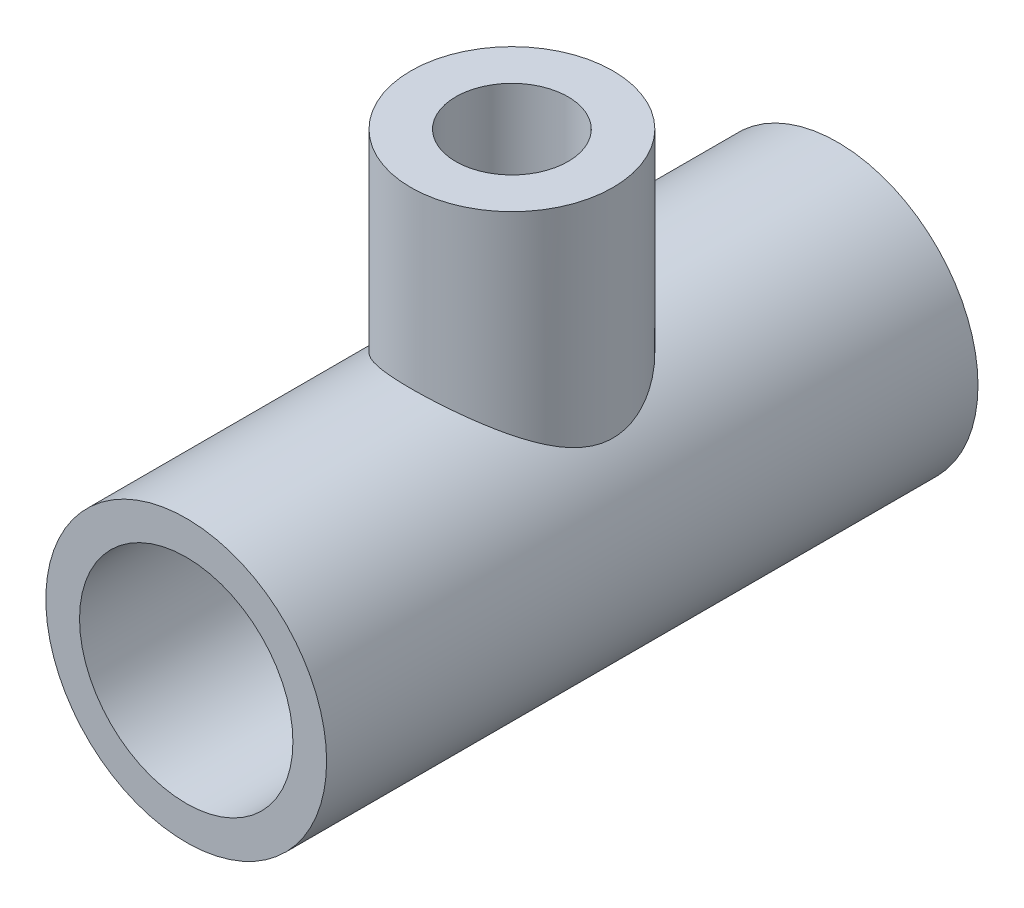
ISO-10303-21;
HEADER;
FILE_DESCRIPTION(('STEP AP214'),'2;1');
FILE_NAME('part.step','',(''),(''),'','','');
FILE_SCHEMA(('AUTOMOTIVE_DESIGN { 1 0 10303 214 1 1 1 1 }'));
ENDSEC;
DATA;
#1=APPLICATION_CONTEXT('core data for automotive mechanical design processes');
#2=APPLICATION_PROTOCOL_DEFINITION('international standard','automotive_design',2000,#1);
#3=PRODUCT_CONTEXT('',#1,'mechanical');
#4=PRODUCT('Part','Part','',(#3));
#5=PRODUCT_RELATED_PRODUCT_CATEGORY('part','',(#4));
#6=PRODUCT_DEFINITION_FORMATION('','',#4);
#7=PRODUCT_DEFINITION_CONTEXT('part definition',#1,'design');
#8=PRODUCT_DEFINITION('design','',#6,#7);
#9=PRODUCT_DEFINITION_SHAPE('','',#8);
#10=(LENGTH_UNIT() NAMED_UNIT(*) SI_UNIT(.MILLI.,.METRE.));
#11=(NAMED_UNIT(*) PLANE_ANGLE_UNIT() SI_UNIT($,.RADIAN.));
#12=(NAMED_UNIT(*) SI_UNIT($,.STERADIAN.) SOLID_ANGLE_UNIT());
#13=UNCERTAINTY_MEASURE_WITH_UNIT(LENGTH_MEASURE(1.E-05),#10,'distance_accuracy_value','');
#14=(GEOMETRIC_REPRESENTATION_CONTEXT(3) GLOBAL_UNCERTAINTY_ASSIGNED_CONTEXT((#13)) GLOBAL_UNIT_ASSIGNED_CONTEXT((#10,
#11,#12)) REPRESENTATION_CONTEXT('',''));
#15=CARTESIAN_POINT('',(0.,0.,0.));
#16=DIRECTION('',(0.,0.,1.));
#17=DIRECTION('',(1.,0.,0.));
#18=AXIS2_PLACEMENT_3D('',#15,#16,#17);
#19=CARTESIAN_POINT('',(0.,0.,29.));
#20=DIRECTION('',(0.,0.,-1.));
#21=DIRECTION('',(-1.,0.,0.));
#22=AXIS2_PLACEMENT_3D('',#19,#20,#21);
#23=CYLINDRICAL_SURFACE('',#22,6.25);
#24=CARTESIAN_POINT('',(0.,0.,29.));
#25=DIRECTION('',(0.,0.,1.));
#26=DIRECTION('',(1.,0.,0.));
#27=AXIS2_PLACEMENT_3D('',#24,#25,#26);
#28=CIRCLE('',#27,6.25);
#29=CARTESIAN_POINT('',(6.25,0.,29.));
#30=VERTEX_POINT('',#29);
#31=EDGE_CURVE('E48',#30,#30,#28,.T.);
#32=ORIENTED_EDGE('',*,*,#31,.F.);
#33=EDGE_LOOP('',(#32));
#34=FACE_BOUND('',#33,.T.);
#35=CARTESIAN_POINT('',(0.,0.,0.));
#36=DIRECTION('',(0.,0.,1.));
#37=DIRECTION('',(1.,0.,0.));
#38=AXIS2_PLACEMENT_3D('',#35,#36,#37);
#39=CIRCLE('',#38,6.25);
#40=CARTESIAN_POINT('',(6.25,0.,0.));
#41=VERTEX_POINT('',#40);
#42=EDGE_CURVE('E52',#41,#41,#39,.T.);
#43=ORIENTED_EDGE('',*,*,#42,.T.);
#44=EDGE_LOOP('',(#43));
#45=FACE_BOUND('',#44,.T.);
#46=CARTESIAN_POINT('',(0.,6.25,10.));
#47=CARTESIAN_POINT('',(-0.11113992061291,6.25000051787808,9.99999945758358));
#48=CARTESIAN_POINT('',(-0.222272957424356,6.24702951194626,10.0041229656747));
#49=CARTESIAN_POINT('',(-0.443657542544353,6.23521934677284,10.0205477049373));
#50=CARTESIAN_POINT('',(-0.553908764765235,6.22637810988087,10.0328518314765));
#51=CARTESIAN_POINT('',(-0.772599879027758,6.20303759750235,10.0654418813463));
#52=CARTESIAN_POINT('',(-0.881040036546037,6.18853915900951,10.0857266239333));
#53=CARTESIAN_POINT('',(-1.09535961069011,6.15422570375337,10.1339633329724));
#54=CARTESIAN_POINT('',(-1.20123790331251,6.13440839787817,10.1619186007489));
#55=CARTESIAN_POINT('',(-1.51281845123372,6.06783979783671,10.2563921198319));
#56=CARTESIAN_POINT('',(-1.71381730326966,6.01381969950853,10.3337257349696));
#57=CARTESIAN_POINT('',(-2.09878970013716,5.89055041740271,10.5137269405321));
#58=CARTESIAN_POINT('',(-2.28276086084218,5.82129910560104,10.6163980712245));
#59=CARTESIAN_POINT('',(-2.6473829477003,5.66538754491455,10.854057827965));
#60=CARTESIAN_POINT('',(-2.82624026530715,5.57772080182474,10.9911251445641));
#61=CARTESIAN_POINT('',(-3.16005720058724,5.3956215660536,11.2884401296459));
#62=CARTESIAN_POINT('',(-3.31498020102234,5.30117902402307,11.4487226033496));
#63=CARTESIAN_POINT('',(-3.54166708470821,5.1506702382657,11.7207930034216));
#64=CARTESIAN_POINT('',(-3.62165422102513,5.09459295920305,11.8258446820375));
#65=CARTESIAN_POINT('',(-3.77246487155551,4.98394874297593,12.0431707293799));
#66=CARTESIAN_POINT('',(-3.84328584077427,4.92938222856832,12.1554470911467));
#67=CARTESIAN_POINT('',(-3.97521811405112,4.82361710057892,12.3868633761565));
#68=CARTESIAN_POINT('',(-4.03634275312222,4.77241391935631,12.5059935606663));
#69=CARTESIAN_POINT('',(-4.14839229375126,4.6753430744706,12.7509979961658));
#70=CARTESIAN_POINT('',(-4.19931883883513,4.6294745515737,12.8768711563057));
#71=CARTESIAN_POINT('',(-4.30608955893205,4.53068429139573,13.1802968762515));
#72=CARTESIAN_POINT('',(-4.3574475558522,4.48088742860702,13.3605546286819));
#73=CARTESIAN_POINT('',(-4.41759766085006,4.42132545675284,13.6375762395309));
#74=CARTESIAN_POINT('',(-4.43482862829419,4.40399877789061,13.7309722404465));
#75=CARTESIAN_POINT('',(-4.46342001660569,4.37502002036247,13.9195200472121));
#76=CARTESIAN_POINT('',(-4.47478278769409,4.36336567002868,14.0146711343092));
#77=CARTESIAN_POINT('',(-4.49147684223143,4.34618014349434,14.2067476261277));
#78=CARTESIAN_POINT('',(-4.49676429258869,4.34069347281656,14.3036808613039));
#79=CARTESIAN_POINT('',(-4.5010467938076,4.33625274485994,14.4978357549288));
#80=CARTESIAN_POINT('',(-4.50004205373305,4.33729847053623,14.5950574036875));
#81=CARTESIAN_POINT('',(-4.49176022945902,4.34587443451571,14.7889890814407));
#82=CARTESIAN_POINT('',(-4.4844801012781,4.35340781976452,14.8856988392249));
#83=CARTESIAN_POINT('',(-4.46379574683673,4.37461368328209,15.0778152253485));
#84=CARTESIAN_POINT('',(-4.45038845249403,4.3882892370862,15.1732211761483));
#85=CARTESIAN_POINT('',(-4.41570421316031,4.42320373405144,15.3735614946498));
#86=CARTESIAN_POINT('',(-4.39366695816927,4.44516164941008,15.4782390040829));
#87=CARTESIAN_POINT('',(-4.34262382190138,4.49504100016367,15.6844499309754));
#88=CARTESIAN_POINT('',(-4.31361325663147,4.52296644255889,15.7859811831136));
#89=CARTESIAN_POINT('',(-4.21667658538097,4.61410566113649,16.085459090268));
#90=CARTESIAN_POINT('',(-4.13888164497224,4.68464344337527,16.2780883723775));
#91=CARTESIAN_POINT('',(-3.99040441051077,4.8109481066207,16.5844863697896));
#92=CARTESIAN_POINT('',(-3.92623794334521,4.86362565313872,16.7028666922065));
#93=CARTESIAN_POINT('',(-3.78822668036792,4.9718730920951,16.9325443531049));
#94=CARTESIAN_POINT('',(-3.71437902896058,5.02744383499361,17.0438395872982));
#95=CARTESIAN_POINT('',(-3.55738310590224,5.13973254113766,17.2591289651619));
#96=CARTESIAN_POINT('',(-3.47422968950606,5.19645112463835,17.3631190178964));
#97=CARTESIAN_POINT('',(-3.29887852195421,5.30949981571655,17.5635162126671));
#98=CARTESIAN_POINT('',(-3.2066763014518,5.36582971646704,17.6599195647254));
#99=CARTESIAN_POINT('',(-3.01243590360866,5.47726231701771,17.8456661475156));
#100=CARTESIAN_POINT('',(-2.91030144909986,5.53234494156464,17.9349209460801));
#101=CARTESIAN_POINT('',(-2.69733776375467,5.6392432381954,18.1045664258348));
#102=CARTESIAN_POINT('',(-2.58650973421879,5.69105935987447,18.1849583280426));
#103=CARTESIAN_POINT('',(-2.35671317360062,5.78999230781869,18.3359822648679));
#104=CARTESIAN_POINT('',(-2.23775984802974,5.83711752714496,18.406631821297));
#105=CARTESIAN_POINT('',(-1.9921828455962,5.92543257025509,18.5373964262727));
#106=CARTESIAN_POINT('',(-1.86556208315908,5.96662462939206,18.5975154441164));
#107=CARTESIAN_POINT('',(-1.54197784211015,6.06013450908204,18.7327498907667));
#108=CARTESIAN_POINT('',(-1.34075439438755,6.1081194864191,18.8009378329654));
#109=CARTESIAN_POINT('',(-0.927277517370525,6.18439983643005,18.9085989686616));
#110=CARTESIAN_POINT('',(-0.715032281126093,6.2127096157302,18.9480931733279));
#111=CARTESIAN_POINT('',(-0.284493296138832,6.24726425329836,18.9962317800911));
#112=CARTESIAN_POINT('',(-0.0661815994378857,6.25343455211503,19.0047719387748));
#113=CARTESIAN_POINT('',(0.368819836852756,6.24290131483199,18.9901382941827));
#114=CARTESIAN_POINT('',(0.585509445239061,6.22619594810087,18.9669619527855));
#115=CARTESIAN_POINT('',(0.999632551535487,6.17289426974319,18.8923518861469));
#116=CARTESIAN_POINT('',(1.1974834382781,6.13736369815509,18.8424307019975));
#117=CARTESIAN_POINT('',(1.58131492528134,6.04985418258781,18.717842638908));
#118=CARTESIAN_POINT('',(1.76729308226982,5.99787186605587,18.6431706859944));
#119=CARTESIAN_POINT('',(2.14005992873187,5.87574872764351,18.4644120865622));
#120=CARTESIAN_POINT('',(2.32548729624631,5.80441464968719,18.3583190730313));
#121=CARTESIAN_POINT('',(2.67661540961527,5.65110666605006,18.1235903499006));
#122=CARTESIAN_POINT('',(2.84230164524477,5.56912502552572,17.9949382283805));
#123=CARTESIAN_POINT('',(3.18099012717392,5.38400136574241,17.6924681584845));
#124=CARTESIAN_POINT('',(3.34983736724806,5.27972344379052,17.5146914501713));
#125=CARTESIAN_POINT('',(3.65691468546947,5.07186704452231,17.1337973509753));
#126=CARTESIAN_POINT('',(3.7951247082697,4.96828906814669,16.9306634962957));
#127=CARTESIAN_POINT('',(4.02135790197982,4.78635489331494,16.5307055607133));
#128=CARTESIAN_POINT('',(4.1137079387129,4.70650104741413,16.337022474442));
#129=CARTESIAN_POINT('',(4.27120846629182,4.56405323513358,15.933019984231));
#130=CARTESIAN_POINT('',(4.33641628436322,4.50142298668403,15.7227367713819));
#131=CARTESIAN_POINT('',(4.42603034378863,4.4131548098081,15.3318921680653));
#132=CARTESIAN_POINT('',(4.45597071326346,4.38263814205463,15.1537323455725));
#133=CARTESIAN_POINT('',(4.49411690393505,4.34352547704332,14.7928044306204));
#134=CARTESIAN_POINT('',(4.50234997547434,4.33490199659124,14.6100424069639));
#135=CARTESIAN_POINT('',(4.49648518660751,4.34098214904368,14.2451620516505));
#136=CARTESIAN_POINT('',(4.48237230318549,4.3557014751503,14.0630442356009));
#137=CARTESIAN_POINT('',(4.43285909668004,4.40607054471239,13.7046208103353));
#138=CARTESIAN_POINT('',(4.39742542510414,4.44175307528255,13.5283247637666));
#139=CARTESIAN_POINT('',(4.29258223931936,4.54346456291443,13.1292210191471));
#140=CARTESIAN_POINT('',(4.21587819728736,4.6155839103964,12.9098876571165));
#141=CARTESIAN_POINT('',(4.0787848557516,4.73600473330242,12.5956216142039));
#142=CARTESIAN_POINT('',(4.02934136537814,4.77824354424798,12.4932075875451));
#143=CARTESIAN_POINT('',(3.92344467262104,4.86557282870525,12.2933384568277));
#144=CARTESIAN_POINT('',(3.86699191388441,4.91066312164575,12.1958830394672));
#145=CARTESIAN_POINT('',(3.68419462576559,5.05105454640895,11.9057870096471));
#146=CARTESIAN_POINT('',(3.54693743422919,5.1491507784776,11.7211734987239));
#147=CARTESIAN_POINT('',(3.32115575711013,5.29533099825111,11.4613999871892));
#148=CARTESIAN_POINT('',(3.24254109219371,5.34391775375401,11.3776342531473));
#149=CARTESIAN_POINT('',(3.07872411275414,5.43994084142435,11.2159934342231));
#150=CARTESIAN_POINT('',(2.99352011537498,5.48737687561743,11.1381198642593));
#151=CARTESIAN_POINT('',(2.79974351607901,5.58910561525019,10.9743123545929));
#152=CARTESIAN_POINT('',(2.68982351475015,5.64296804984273,10.8896978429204));
#153=CARTESIAN_POINT('',(2.46128494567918,5.74632875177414,10.7301882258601));
#154=CARTESIAN_POINT('',(2.34267030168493,5.79582896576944,10.6552887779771));
#155=CARTESIAN_POINT('',(2.09730498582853,5.88905954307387,10.5161341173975));
#156=CARTESIAN_POINT('',(1.97056005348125,5.93279391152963,10.4518715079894));
#157=CARTESIAN_POINT('',(1.70967495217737,6.01316232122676,10.3349762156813));
#158=CARTESIAN_POINT('',(1.57553720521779,6.04979867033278,10.2823397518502));
#159=CARTESIAN_POINT('',(1.32442882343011,6.10918037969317,10.1976365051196));
#160=CARTESIAN_POINT('',(1.20843053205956,6.13322912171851,10.1635927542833));
#161=CARTESIAN_POINT('',(0.972996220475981,6.17495422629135,10.1047763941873));
#162=CARTESIAN_POINT('',(0.853561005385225,6.19263206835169,10.0800016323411));
#163=CARTESIAN_POINT('',(0.612390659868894,6.22110974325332,10.0401906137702));
#164=CARTESIAN_POINT('',(0.490657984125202,6.23191653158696,10.0251445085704));
#165=CARTESIAN_POINT('',(0.245947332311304,6.24636109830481,10.0050498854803));
#166=CARTESIAN_POINT('',(0.122969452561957,6.24999942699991,10.0000006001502));
#167=CARTESIAN_POINT('',(0.,6.25,10.));
#168=B_SPLINE_CURVE_WITH_KNOTS('',3,(#46,#47,#48,#49,#50,#51,#52,#53,#54,#55,#56,#57,#58,#59,
#60,#61,#62,#63,#64,#65,#66,#67,#68,#69,#70,#71,#72,#73,#74,#75,#76,#77,#78,#79,#80,#81,#82,#83,
#84,#85,#86,#87,#88,#89,#90,#91,#92,#93,#94,#95,#96,#97,#98,#99,#100,#101,#102,#103,#104,#105,
#106,#107,#108,#109,#110,#111,#112,#113,#114,#115,#116,#117,#118,#119,#120,#121,#122,#123,#124,
#125,#126,#127,#128,#129,#130,#131,#132,#133,#134,#135,#136,#137,#138,#139,#140,#141,#142,#143,
#144,#145,#146,#147,#148,#149,#150,#151,#152,#153,#154,#155,#156,#157,#158,#159,#160,#161,#162,
#163,#164,#165,#166,#167),.UNSPECIFIED.,.T.,.F.,(4,2,2,2,2,2,2,2,2,2,2,2,2,2,2,2,2,2,2,2,2,2,2,
2,2,2,2,2,2,2,2,2,2,2,2,2,2,2,2,2,2,2,2,2,2,2,2,2,2,2,2,2,2,2,2,2,2,2,2,2,4),(0.,
0.33329219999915,0.666702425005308,1.00006334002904,1.3335679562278,1.99650505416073,
2.65953483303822,3.38232132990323,4.10620289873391,4.53614678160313,4.96620978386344,
5.39567611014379,5.82507316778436,6.40432316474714,6.69364695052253,6.98285477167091,
7.27413636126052,7.56540827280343,7.8568215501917,8.14838090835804,8.47549572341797,
8.80283087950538,9.45811862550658,9.89145431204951,10.3249181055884,10.7586227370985,
11.1925426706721,11.6311934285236,12.0697836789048,12.5075745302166,12.945200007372,
13.5956712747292,14.2456657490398,14.8978471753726,15.5500807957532,16.1688134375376,
16.7876729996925,17.4608453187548,18.1345094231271,18.9307591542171,19.7275285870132,
20.4120760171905,21.0951701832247,21.6424706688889,22.1890837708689,22.7360645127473,
23.2839030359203,24.0095421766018,24.373238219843,24.7369112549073,25.4841841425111,
25.8581426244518,26.2321969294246,26.6780060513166,27.1236152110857,27.5689131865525,
28.0140661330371,28.3833217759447,28.7524916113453,29.1212871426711,29.4900543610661),.UNSPECIFIED.);
#169=CARTESIAN_POINT('',(0.,6.25,10.));
#170=VERTEX_POINT('',#169);
#171=EDGE_CURVE('E10',#170,#170,#168,.T.);
#172=ORIENTED_EDGE('',*,*,#171,.F.);
#173=EDGE_LOOP('',(#172));
#174=FACE_BOUND('',#173,.T.);
#175=ADVANCED_FACE('F37',(#34,#45,#174),#23,.T.);
#176=CARTESIAN_POINT('',(0.,0.,29.));
#177=DIRECTION('',(0.,0.,1.));
#178=DIRECTION('',(1.,0.,0.));
#179=AXIS2_PLACEMENT_3D('',#176,#177,#178);
#180=PLANE('',#179);
#181=CARTESIAN_POINT('',(0.,0.,29.));
#182=DIRECTION('',(0.,0.,1.));
#183=DIRECTION('',(1.,0.,0.));
#184=AXIS2_PLACEMENT_3D('',#181,#182,#183);
#185=CIRCLE('',#184,4.75);
#186=CARTESIAN_POINT('',(-4.75,0.,29.));
#187=VERTEX_POINT('',#186);
#188=EDGE_CURVE('E65',#187,#187,#185,.T.);
#189=ORIENTED_EDGE('',*,*,#188,.F.);
#190=EDGE_LOOP('',(#189));
#191=FACE_BOUND('',#190,.T.);
#192=ORIENTED_EDGE('',*,*,#31,.T.);
#193=EDGE_LOOP('',(#192));
#194=FACE_BOUND('',#193,.T.);
#195=ADVANCED_FACE('F80',(#191,#194),#180,.T.);
#196=CARTESIAN_POINT('',(0.,0.,0.));
#197=DIRECTION('',(0.,0.,1.));
#198=DIRECTION('',(1.,0.,0.));
#199=AXIS2_PLACEMENT_3D('',#196,#197,#198);
#200=PLANE('',#199);
#201=CARTESIAN_POINT('',(0.,0.,0.));
#202=DIRECTION('',(0.,0.,-1.));
#203=DIRECTION('',(-1.,0.,0.));
#204=AXIS2_PLACEMENT_3D('',#201,#202,#203);
#205=CIRCLE('',#204,4.75);
#206=CARTESIAN_POINT('',(-4.75,0.,0.));
#207=VERTEX_POINT('',#206);
#208=EDGE_CURVE('E70',#207,#207,#205,.T.);
#209=ORIENTED_EDGE('',*,*,#208,.F.);
#210=EDGE_LOOP('',(#209));
#211=FACE_BOUND('',#210,.T.);
#212=ORIENTED_EDGE('',*,*,#42,.F.);
#213=EDGE_LOOP('',(#212));
#214=FACE_BOUND('',#213,.T.);
#215=ADVANCED_FACE('F76',(#211,#214),#200,.F.);
#216=CARTESIAN_POINT('',(0.,14.,14.5));
#217=DIRECTION('',(0.,-1.,0.));
#218=DIRECTION('',(0.,0.,-1.));
#219=AXIS2_PLACEMENT_3D('',#216,#217,#218);
#220=CYLINDRICAL_SURFACE('',#219,4.5);
#221=CARTESIAN_POINT('',(0.,14.,14.5));
#222=DIRECTION('',(0.,1.,0.));
#223=DIRECTION('',(0.,0.,1.));
#224=AXIS2_PLACEMENT_3D('',#221,#222,#223);
#225=CIRCLE('',#224,4.5);
#226=CARTESIAN_POINT('',(0.,14.,19.));
#227=VERTEX_POINT('',#226);
#228=EDGE_CURVE('E57',#227,#227,#225,.T.);
#229=ORIENTED_EDGE('',*,*,#228,.F.);
#230=EDGE_LOOP('',(#229));
#231=FACE_BOUND('',#230,.T.);
#232=ORIENTED_EDGE('',*,*,#171,.T.);
#233=EDGE_LOOP('',(#232));
#234=FACE_BOUND('',#233,.T.);
#235=ADVANCED_FACE('F79',(#231,#234),#220,.T.);
#236=CARTESIAN_POINT('',(0.,14.,14.5));
#237=DIRECTION('',(0.,1.,0.));
#238=DIRECTION('',(0.,0.,1.));
#239=AXIS2_PLACEMENT_3D('',#236,#237,#238);
#240=PLANE('',#239);
#241=CARTESIAN_POINT('',(0.,14.,14.5));
#242=DIRECTION('',(0.,1.,0.));
#243=DIRECTION('',(0.,0.,1.));
#244=AXIS2_PLACEMENT_3D('',#241,#242,#243);
#245=CIRCLE('',#244,2.5);
#246=CARTESIAN_POINT('',(0.,14.,17.));
#247=VERTEX_POINT('',#246);
#248=EDGE_CURVE('E62',#247,#247,#245,.T.);
#249=ORIENTED_EDGE('',*,*,#248,.F.);
#250=EDGE_LOOP('',(#249));
#251=FACE_BOUND('',#250,.T.);
#252=ORIENTED_EDGE('',*,*,#228,.T.);
#253=EDGE_LOOP('',(#252));
#254=FACE_BOUND('',#253,.T.);
#255=ADVANCED_FACE('F97',(#251,#254),#240,.T.);
#256=CARTESIAN_POINT('',(0.,8.,14.5));
#257=DIRECTION('',(0.,1.,0.));
#258=DIRECTION('',(0.,0.,1.));
#259=AXIS2_PLACEMENT_3D('',#256,#257,#258);
#260=CYLINDRICAL_SURFACE('',#259,2.5);
#261=CARTESIAN_POINT('',(0.,8.,14.5));
#262=DIRECTION('',(0.,1.,0.));
#263=DIRECTION('',(0.,0.,1.));
#264=AXIS2_PLACEMENT_3D('',#261,#262,#263);
#265=CIRCLE('',#264,2.5);
#266=CARTESIAN_POINT('',(0.,8.,17.));
#267=VERTEX_POINT('',#266);
#268=EDGE_CURVE('E61',#267,#267,#265,.T.);
#269=ORIENTED_EDGE('',*,*,#268,.F.);
#270=EDGE_LOOP('',(#269));
#271=FACE_BOUND('',#270,.T.);
#272=ORIENTED_EDGE('',*,*,#248,.T.);
#273=EDGE_LOOP('',(#272));
#274=FACE_BOUND('',#273,.T.);
#275=ADVANCED_FACE('F101',(#271,#274),#260,.F.);
#276=CARTESIAN_POINT('',(0.,8.,14.5));
#277=DIRECTION('',(0.,1.,0.));
#278=DIRECTION('',(0.,0.,1.));
#279=AXIS2_PLACEMENT_3D('',#276,#277,#278);
#280=PLANE('',#279);
#281=ORIENTED_EDGE('',*,*,#268,.T.);
#282=EDGE_LOOP('',(#281));
#283=FACE_BOUND('',#282,.T.);
#284=ADVANCED_FACE('F105',(#283),#280,.T.);
#285=CARTESIAN_POINT('',(0.,0.,119.785927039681));
#286=DIRECTION('',(0.,0.,-1.));
#287=DIRECTION('',(-1.,0.,0.));
#288=AXIS2_PLACEMENT_3D('',#285,#286,#287);
#289=CYLINDRICAL_SURFACE('',#288,4.75);
#290=CARTESIAN_POINT('',(-4.75,0.,29.));
#291=CARTESIAN_POINT('',(-4.75,0.,28.6979166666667));
#292=CARTESIAN_POINT('',(-4.75,0.,28.3958333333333));
#293=CARTESIAN_POINT('',(-4.75,0.,27.7916666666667));
#294=CARTESIAN_POINT('',(-4.75,0.,27.4895833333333));
#295=CARTESIAN_POINT('',(-4.75,0.,26.8854166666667));
#296=CARTESIAN_POINT('',(-4.75,0.,26.5833333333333));
#297=CARTESIAN_POINT('',(-4.75,0.,25.9791666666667));
#298=CARTESIAN_POINT('',(-4.75,0.,25.6770833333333));
#299=CARTESIAN_POINT('',(-4.75,0.,25.0729166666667));
#300=CARTESIAN_POINT('',(-4.75,0.,24.7708333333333));
#301=CARTESIAN_POINT('',(-4.75,0.,24.1666666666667));
#302=CARTESIAN_POINT('',(-4.75,0.,23.8645833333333));
#303=CARTESIAN_POINT('',(-4.75,0.,23.2604166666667));
#304=CARTESIAN_POINT('',(-4.75,0.,22.9583333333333));
#305=CARTESIAN_POINT('',(-4.75,0.,22.3541666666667));
#306=CARTESIAN_POINT('',(-4.75,0.,22.0520833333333));
#307=CARTESIAN_POINT('',(-4.75,0.,21.4479166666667));
#308=CARTESIAN_POINT('',(-4.75,0.,21.1458333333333));
#309=CARTESIAN_POINT('',(-4.75,0.,20.5416666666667));
#310=CARTESIAN_POINT('',(-4.75,0.,20.2395833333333));
#311=CARTESIAN_POINT('',(-4.75,0.,19.6354166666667));
#312=CARTESIAN_POINT('',(-4.75,0.,19.3333333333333));
#313=CARTESIAN_POINT('',(-4.75,0.,18.7291666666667));
#314=CARTESIAN_POINT('',(-4.75,0.,18.4270833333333));
#315=CARTESIAN_POINT('',(-4.75,0.,17.8229166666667));
#316=CARTESIAN_POINT('',(-4.75,0.,17.5208333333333));
#317=CARTESIAN_POINT('',(-4.75,0.,16.9166666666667));
#318=CARTESIAN_POINT('',(-4.75,0.,16.6145833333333));
#319=CARTESIAN_POINT('',(-4.75,0.,16.0104166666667));
#320=CARTESIAN_POINT('',(-4.75,0.,15.7083333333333));
#321=CARTESIAN_POINT('',(-4.75,0.,15.1041666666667));
#322=CARTESIAN_POINT('',(-4.75,0.,14.8020833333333));
#323=CARTESIAN_POINT('',(-4.75,0.,14.1979166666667));
#324=CARTESIAN_POINT('',(-4.75,0.,13.8958333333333));
#325=CARTESIAN_POINT('',(-4.75,0.,13.2916666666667));
#326=CARTESIAN_POINT('',(-4.75,0.,12.9895833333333));
#327=CARTESIAN_POINT('',(-4.75,0.,12.3854166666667));
#328=CARTESIAN_POINT('',(-4.75,0.,12.0833333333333));
#329=CARTESIAN_POINT('',(-4.75,0.,11.4791666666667));
#330=CARTESIAN_POINT('',(-4.75,0.,11.1770833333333));
#331=CARTESIAN_POINT('',(-4.75,0.,10.5729166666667));
#332=CARTESIAN_POINT('',(-4.75,0.,10.2708333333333));
#333=CARTESIAN_POINT('',(-4.75,0.,9.66666666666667));
#334=CARTESIAN_POINT('',(-4.75,0.,9.36458333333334));
#335=CARTESIAN_POINT('',(-4.75,0.,8.76041666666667));
#336=CARTESIAN_POINT('',(-4.75,0.,8.45833333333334));
#337=CARTESIAN_POINT('',(-4.75,0.,7.85416666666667));
#338=CARTESIAN_POINT('',(-4.75,0.,7.55208333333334));
#339=CARTESIAN_POINT('',(-4.75,0.,6.94791666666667));
#340=CARTESIAN_POINT('',(-4.75,0.,6.64583333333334));
#341=CARTESIAN_POINT('',(-4.75,0.,6.04166666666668));
#342=CARTESIAN_POINT('',(-4.75,0.,5.73958333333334));
#343=CARTESIAN_POINT('',(-4.75,0.,5.13541666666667));
#344=CARTESIAN_POINT('',(-4.75,0.,4.83333333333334));
#345=CARTESIAN_POINT('',(-4.75,0.,4.22916666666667));
#346=CARTESIAN_POINT('',(-4.75,0.,3.92708333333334));
#347=CARTESIAN_POINT('',(-4.75,0.,3.32291666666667));
#348=CARTESIAN_POINT('',(-4.75,0.,3.02083333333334));
#349=CARTESIAN_POINT('',(-4.75,0.,2.41666666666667));
#350=CARTESIAN_POINT('',(-4.75,0.,2.11458333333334));
#351=CARTESIAN_POINT('',(-4.75,0.,1.51041666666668));
#352=CARTESIAN_POINT('',(-4.75,0.,1.20833333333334));
#353=CARTESIAN_POINT('',(-4.75,0.,0.604166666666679));
#354=CARTESIAN_POINT('',(-4.75,0.,0.302083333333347));
#355=CARTESIAN_POINT('',(-4.75,0.,0.));
#356=B_SPLINE_CURVE_WITH_KNOTS('',3,(#290,#291,#292,#293,#294,#295,#296,#297,#298,#299,#300,
#301,#302,#303,#304,#305,#306,#307,#308,#309,#310,#311,#312,#313,#314,#315,#316,#317,#318,#319,
#320,#321,#322,#323,#324,#325,#326,#327,#328,#329,#330,#331,#332,#333,#334,#335,#336,#337,#338,
#339,#340,#341,#342,#343,#344,#345,#346,#347,#348,#349,#350,#351,#352,#353,#354,#355),
.UNSPECIFIED.,.F.,.F.,(4,2,2,2,2,2,2,2,2,2,2,2,2,2,2,2,2,2,2,2,2,2,2,2,2,2,2,2,2,2,2,2,4),(0.,
0.906249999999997,1.81249999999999,2.71874999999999,3.62499999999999,4.53125,5.4375,6.34375,
7.24999999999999,8.15624999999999,9.06249999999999,9.96874999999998,10.875,11.78125,12.6875,
13.59375,14.5,15.40625,16.3125,17.21875,18.125,19.03125,19.9375,20.84375,21.75,22.65625,23.5625,
24.46875,25.375,26.28125,27.1875,28.09375,29.),.UNSPECIFIED.);
#357=EDGE_CURVE('BSEAM74',#187,#207,#356,.T.);
#358=ORIENTED_EDGE('',*,*,#188,.T.);
#359=ORIENTED_EDGE('',*,*,#208,.T.);
#360=ORIENTED_EDGE('',*,*,#357,.T.);
#361=ORIENTED_EDGE('',*,*,#357,.F.);
#362=EDGE_LOOP('',(#358,#360,#359,#361));
#363=FACE_BOUND('',#362,.T.);
#364=ADVANCED_FACE('F74',(#363),#289,.F.);
#365=CLOSED_SHELL('',(#175,#195,#215,#235,#255,#275,#284,#364));
#366=MANIFOLD_SOLID_BREP('B2',#365);
#367=ADVANCED_BREP_SHAPE_REPRESENTATION('',(#18,#366),#14);
#368=SHAPE_DEFINITION_REPRESENTATION(#9,#367);
ENDSEC;
END-ISO-10303-21;
